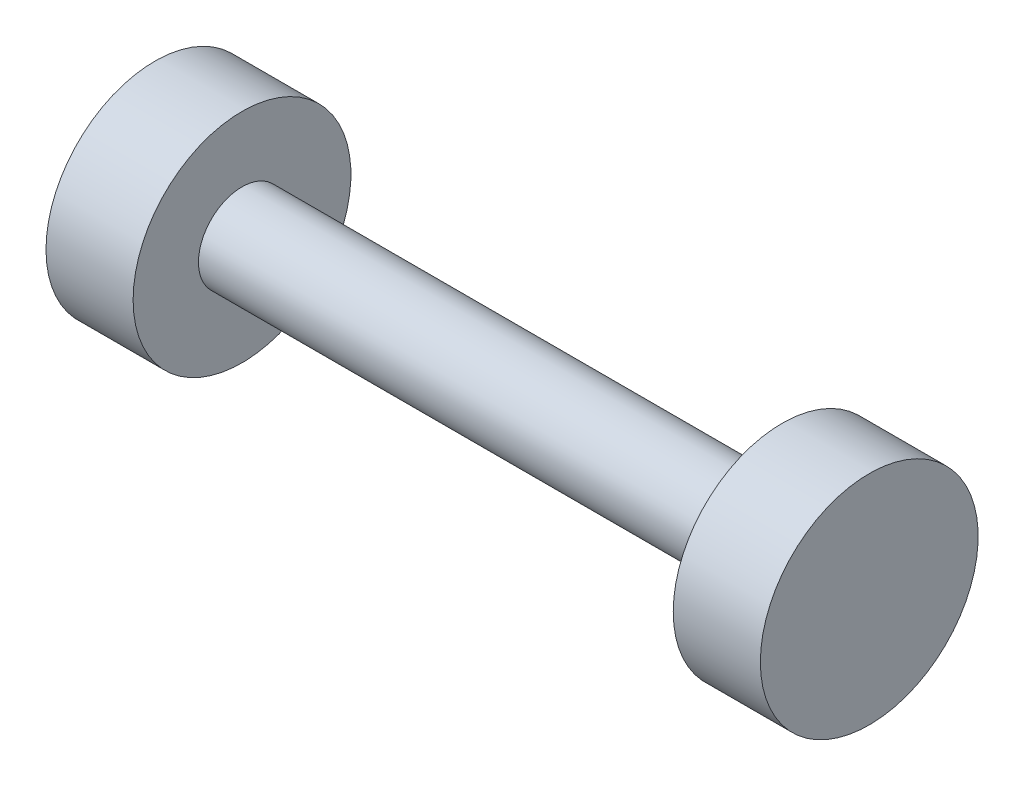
from build123d import *


with BuildPart() as part:
    # Esquisse1 → Base-R_volution (revolve)
    with BuildSketch(Plane.XY, mode=Mode.PRIVATE) as base_r_volution_sk:
        Polygon((-8.2, 0), (-8.2, 2.5), (-6.2, 2.5), (-6.2, 1), (6.2, 1), (6.2, 2.5), (8.2, 2.5), (8.2, 0), align=None)
    revolve(base_r_volution_sk.sketch.rotate(Axis((-31.619341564, 0, 0), (1, 0, 0)), 90), axis=Axis((-31.619341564, 0, 0), (1, 0, 0)))


solid = part.part
